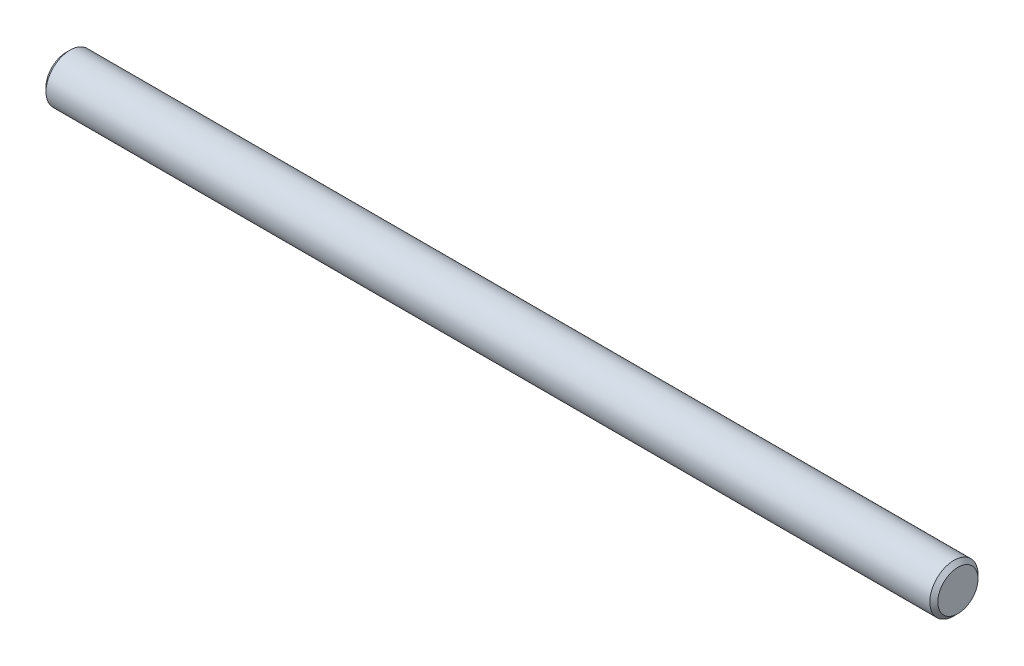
ISO-10303-21;
HEADER;
FILE_DESCRIPTION(('STEP AP214'),'2;1');
FILE_NAME('part.step','',(''),(''),'','','');
FILE_SCHEMA(('AUTOMOTIVE_DESIGN { 1 0 10303 214 1 1 1 1 }'));
ENDSEC;
DATA;
#1=APPLICATION_CONTEXT('core data for automotive mechanical design processes');
#2=APPLICATION_PROTOCOL_DEFINITION('international standard','automotive_design',2000,#1);
#3=PRODUCT_CONTEXT('',#1,'mechanical');
#4=PRODUCT('Part','Part','',(#3));
#5=PRODUCT_RELATED_PRODUCT_CATEGORY('part','',(#4));
#6=PRODUCT_DEFINITION_FORMATION('','',#4);
#7=PRODUCT_DEFINITION_CONTEXT('part definition',#1,'design');
#8=PRODUCT_DEFINITION('design','',#6,#7);
#9=PRODUCT_DEFINITION_SHAPE('','',#8);
#10=(LENGTH_UNIT() NAMED_UNIT(*) SI_UNIT(.MILLI.,.METRE.));
#11=(NAMED_UNIT(*) PLANE_ANGLE_UNIT() SI_UNIT($,.RADIAN.));
#12=(NAMED_UNIT(*) SI_UNIT($,.STERADIAN.) SOLID_ANGLE_UNIT());
#13=UNCERTAINTY_MEASURE_WITH_UNIT(LENGTH_MEASURE(1.E-05),#10,'distance_accuracy_value','');
#14=(GEOMETRIC_REPRESENTATION_CONTEXT(3) GLOBAL_UNCERTAINTY_ASSIGNED_CONTEXT((#13)) GLOBAL_UNIT_ASSIGNED_CONTEXT((#10,
#11,#12)) REPRESENTATION_CONTEXT('',''));
#15=CARTESIAN_POINT('',(0.,0.,0.));
#16=DIRECTION('',(0.,0.,1.));
#17=DIRECTION('',(1.,0.,0.));
#18=AXIS2_PLACEMENT_3D('',#15,#16,#17);
#19=CARTESIAN_POINT('',(222.,0.,0.));
#20=DIRECTION('',(-1.,0.,0.));
#21=DIRECTION('',(0.,0.,1.));
#22=AXIS2_PLACEMENT_3D('',#19,#20,#21);
#23=CYLINDRICAL_SURFACE('',#22,6.);
#24=CARTESIAN_POINT('',(221.,0.,0.));
#25=DIRECTION('',(1.,0.,0.));
#26=DIRECTION('',(0.,0.,-1.));
#27=AXIS2_PLACEMENT_3D('',#24,#25,#26);
#28=CIRCLE('',#27,6.);
#29=CARTESIAN_POINT('',(221.,0.,-6.));
#30=VERTEX_POINT('',#29);
#31=EDGE_CURVE('E9178',#30,#30,#28,.F.);
#32=ORIENTED_EDGE('',*,*,#31,.T.);
#33=EDGE_LOOP('',(#32));
#34=FACE_BOUND('',#33,.T.);
#35=CARTESIAN_POINT('',(1.,0.,0.));
#36=DIRECTION('',(1.,0.,0.));
#37=DIRECTION('',(0.,0.,-1.));
#38=AXIS2_PLACEMENT_3D('',#35,#36,#37);
#39=CIRCLE('',#38,6.);
#40=CARTESIAN_POINT('',(1.,0.,-6.));
#41=VERTEX_POINT('',#40);
#42=EDGE_CURVE('E9182',#41,#41,#39,.T.);
#43=ORIENTED_EDGE('',*,*,#42,.T.);
#44=EDGE_LOOP('',(#43));
#45=FACE_BOUND('',#44,.T.);
#46=ADVANCED_FACE('F9172',(#34,#45),#23,.T.);
#47=CARTESIAN_POINT('',(222.,0.,0.));
#48=DIRECTION('',(1.,0.,0.));
#49=DIRECTION('',(0.,0.,-1.));
#50=AXIS2_PLACEMENT_3D('',#47,#48,#49);
#51=PLANE('',#50);
#52=CARTESIAN_POINT('',(222.,0.,0.));
#53=DIRECTION('',(1.,0.,0.));
#54=DIRECTION('',(0.,0.,-1.));
#55=AXIS2_PLACEMENT_3D('',#52,#53,#54);
#56=CIRCLE('',#55,5.);
#57=CARTESIAN_POINT('',(222.,0.,-5.));
#58=VERTEX_POINT('',#57);
#59=EDGE_CURVE('E9186',#58,#58,#56,.T.);
#60=ORIENTED_EDGE('',*,*,#59,.T.);
#61=EDGE_LOOP('',(#60));
#62=FACE_BOUND('',#61,.T.);
#63=ADVANCED_FACE('F9192',(#62),#51,.T.);
#64=CARTESIAN_POINT('',(0.,0.,0.));
#65=DIRECTION('',(1.,0.,0.));
#66=DIRECTION('',(0.,0.,-1.));
#67=AXIS2_PLACEMENT_3D('',#64,#65,#66);
#68=PLANE('',#67);
#69=CARTESIAN_POINT('',(0.,0.,0.));
#70=DIRECTION('',(1.,0.,0.));
#71=DIRECTION('',(0.,0.,-1.));
#72=AXIS2_PLACEMENT_3D('',#69,#70,#71);
#73=CIRCLE('',#72,5.00000000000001);
#74=CARTESIAN_POINT('',(0.,0.,-5.00000000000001));
#75=VERTEX_POINT('',#74);
#76=EDGE_CURVE('E10',#75,#75,#73,.F.);
#77=ORIENTED_EDGE('',*,*,#76,.T.);
#78=EDGE_LOOP('',(#77));
#79=FACE_BOUND('',#78,.T.);
#80=ADVANCED_FACE('F9197',(#79),#68,.F.);
#81=CARTESIAN_POINT('',(222.,0.,0.));
#82=DIRECTION('',(-1.,0.,0.));
#83=DIRECTION('',(0.,0.,1.));
#84=AXIS2_PLACEMENT_3D('',#81,#82,#83);
#85=CONICAL_SURFACE('',#84,5.,0.785398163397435);
#86=ORIENTED_EDGE('',*,*,#31,.F.);
#87=EDGE_LOOP('',(#86));
#88=FACE_BOUND('',#87,.T.);
#89=ORIENTED_EDGE('',*,*,#59,.F.);
#90=EDGE_LOOP('',(#89));
#91=FACE_BOUND('',#90,.T.);
#92=ADVANCED_FACE('F9194',(#88,#91),#85,.T.);
#93=CARTESIAN_POINT('',(1.,0.,0.));
#94=DIRECTION('',(1.,0.,0.));
#95=DIRECTION('',(0.,0.,-1.));
#96=AXIS2_PLACEMENT_3D('',#93,#94,#95);
#97=CONICAL_SURFACE('',#96,6.,0.785398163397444);
#98=ORIENTED_EDGE('',*,*,#76,.F.);
#99=EDGE_LOOP('',(#98));
#100=FACE_BOUND('',#99,.T.);
#101=ORIENTED_EDGE('',*,*,#42,.F.);
#102=EDGE_LOOP('',(#101));
#103=FACE_BOUND('',#102,.T.);
#104=ADVANCED_FACE('F9196',(#100,#103),#97,.T.);
#105=CLOSED_SHELL('',(#46,#63,#80,#92,#104));
#106=MANIFOLD_SOLID_BREP('B2',#105);
#107=ADVANCED_BREP_SHAPE_REPRESENTATION('',(#18,#106),#14);
#108=SHAPE_DEFINITION_REPRESENTATION(#9,#107);
ENDSEC;
END-ISO-10303-21;
